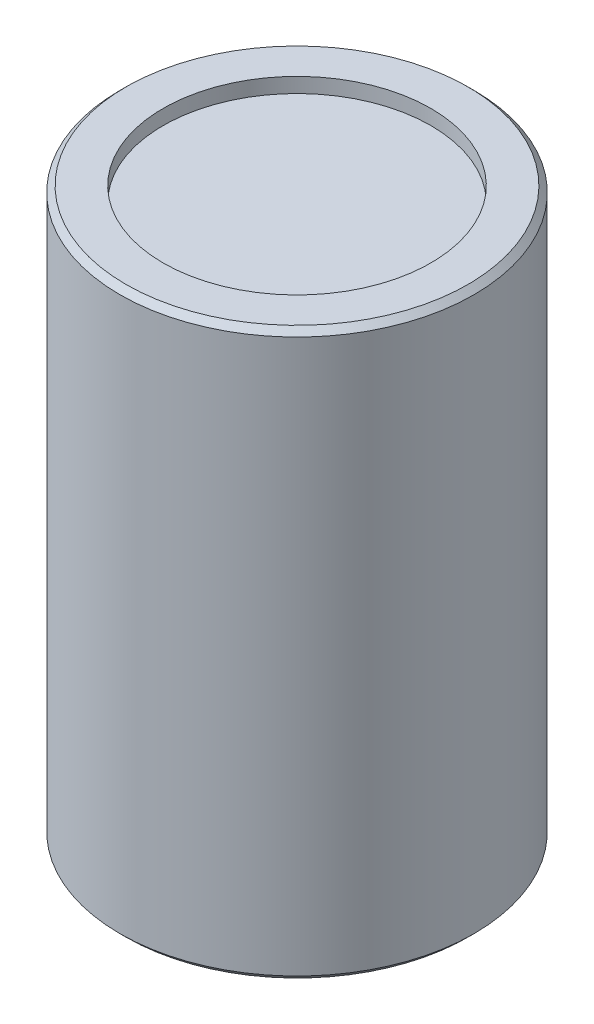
from build123d import *

# Parameters (mm, degrees)
IZIM1_R                     = 59.5
Y_KSEKLIK_EKSTR_ZYON1_DEPTH = 190
IZIM2_R                     = 45
KES_EKSTR_ZYON1_DEPTH       = 5
PAH1_SIZE                   = 2
PAH2_SIZE                   = 2
IZIM3_R                     = 45
Y_KSEKLIK_EKSTR_ZYON2_DEPTH = 6


with BuildPart() as part:
    # izim1 → Y_kseklik-Ekstr_zyon1 (new body)
    with BuildSketch(Plane(origin=(0, 0, 0), x_dir=(1, 0, 0), z_dir=(0, 1, 0))):
        with Locations(Location((0, 0, 0), (0, 0, 270))):
            Circle(IZIM1_R)
    extrude(amount=Y_KSEKLIK_EKSTR_ZYON1_DEPTH)

    # izim2 → Kes-Ekstr_zyon1 (cut)
    with BuildSketch(Plane(origin=(0, 190, 0), x_dir=(1, 0, 0), z_dir=(0, 1, 0))):
        with Locations(Location((0, 0, 0), (0, 0, 270))):
            Circle(IZIM2_R)
    extrude(amount=-KES_EKSTR_ZYON1_DEPTH, mode=Mode.SUBTRACT)

    # Pah1
    pah1_edges = [part.edges().sort_by_distance(p)[0] for p in [
        (0, 190, -59.5),
    ]]
    chamfer(pah1_edges, length=PAH1_SIZE)

    # Pah2
    pah2_edges = [part.edges().sort_by_distance(p)[0] for p in [
        (0, 0, -59.5),
    ]]
    chamfer(pah2_edges, length=PAH2_SIZE)

    # izim3 → Y_kseklik-Ekstr_zyon2 (add)
    with BuildSketch(Plane.XZ):
        with Locations(Location((0, 0, 0), (0, 0, 90))):
            Circle(IZIM3_R)
    extrude(amount=Y_KSEKLIK_EKSTR_ZYON2_DEPTH)


solid = part.part
